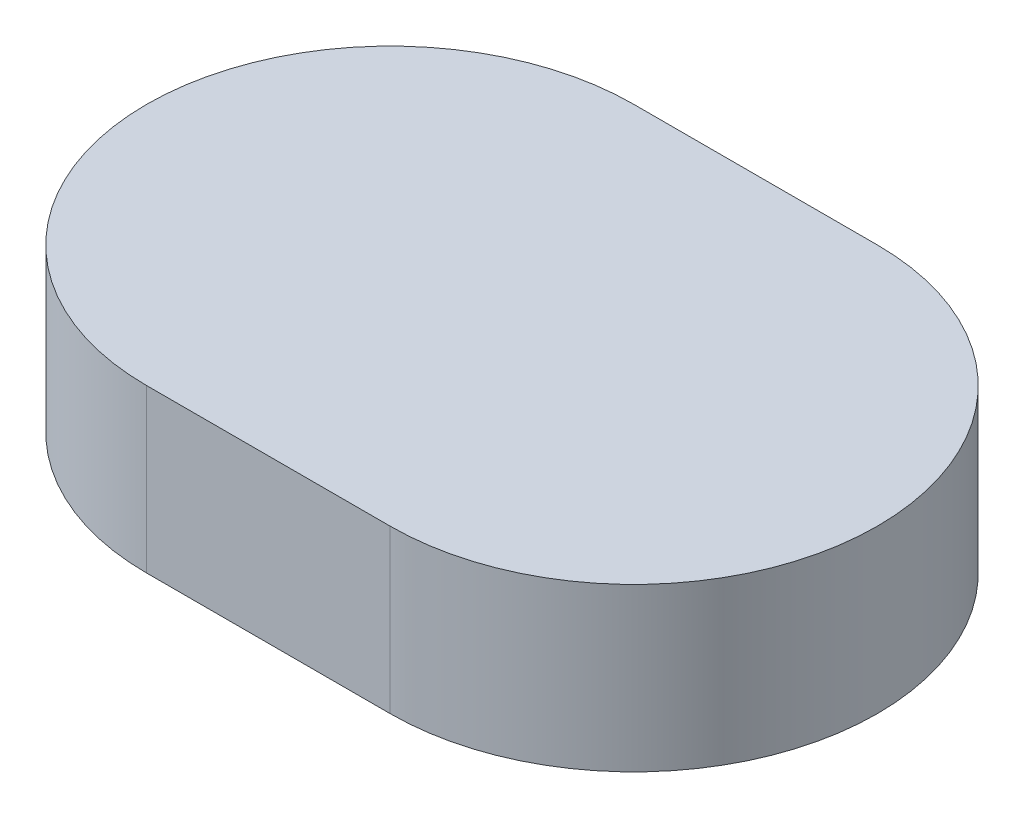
ISO-10303-21;
HEADER;
FILE_DESCRIPTION(('STEP AP214'),'2;1');
FILE_NAME('part.step','',(''),(''),'','','');
FILE_SCHEMA(('AUTOMOTIVE_DESIGN { 1 0 10303 214 1 1 1 1 }'));
ENDSEC;
DATA;
#1=APPLICATION_CONTEXT('core data for automotive mechanical design processes');
#2=APPLICATION_PROTOCOL_DEFINITION('international standard','automotive_design',2000,#1);
#3=PRODUCT_CONTEXT('',#1,'mechanical');
#4=PRODUCT('Part','Part','',(#3));
#5=PRODUCT_RELATED_PRODUCT_CATEGORY('part','',(#4));
#6=PRODUCT_DEFINITION_FORMATION('','',#4);
#7=PRODUCT_DEFINITION_CONTEXT('part definition',#1,'design');
#8=PRODUCT_DEFINITION('design','',#6,#7);
#9=PRODUCT_DEFINITION_SHAPE('','',#8);
#10=(LENGTH_UNIT() NAMED_UNIT(*) SI_UNIT(.MILLI.,.METRE.));
#11=(NAMED_UNIT(*) PLANE_ANGLE_UNIT() SI_UNIT($,.RADIAN.));
#12=(NAMED_UNIT(*) SI_UNIT($,.STERADIAN.) SOLID_ANGLE_UNIT());
#13=UNCERTAINTY_MEASURE_WITH_UNIT(LENGTH_MEASURE(1.E-05),#10,'distance_accuracy_value','');
#14=(GEOMETRIC_REPRESENTATION_CONTEXT(3) GLOBAL_UNCERTAINTY_ASSIGNED_CONTEXT((#13)) GLOBAL_UNIT_ASSIGNED_CONTEXT((#10,
#11,#12)) REPRESENTATION_CONTEXT('',''));
#15=CARTESIAN_POINT('',(0.,0.,0.));
#16=DIRECTION('',(0.,0.,1.));
#17=DIRECTION('',(1.,0.,0.));
#18=AXIS2_PLACEMENT_3D('',#15,#16,#17);
#19=CARTESIAN_POINT('',(-1.5,2.,0.));
#20=DIRECTION('',(0.,-1.,0.));
#21=DIRECTION('',(0.,0.,-1.));
#22=AXIS2_PLACEMENT_3D('',#19,#20,#21);
#23=CYLINDRICAL_SURFACE('',#22,3.);
#24=CARTESIAN_POINT('',(-1.5,0.,0.));
#25=DIRECTION('',(0.,1.,0.));
#26=DIRECTION('',(0.,0.,1.));
#27=AXIS2_PLACEMENT_3D('',#24,#25,#26);
#28=CIRCLE('',#27,3.);
#29=CARTESIAN_POINT('',(-1.5,0.,-3.));
#30=VERTEX_POINT('',#29);
#31=CARTESIAN_POINT('',(-1.5,0.,3.));
#32=VERTEX_POINT('',#31);
#33=EDGE_CURVE('E95',#30,#32,#28,.T.);
#34=ORIENTED_EDGE('',*,*,#33,.T.);
#35=DIRECTION('',(0.,-1.,0.));
#36=VECTOR('',#35,1.);
#37=CARTESIAN_POINT('',(-1.5,2.,3.));
#38=LINE('',#37,#36);
#39=CARTESIAN_POINT('',(-1.5,2.,3.));
#40=VERTEX_POINT('',#39);
#41=EDGE_CURVE('E11',#40,#32,#38,.T.);
#42=ORIENTED_EDGE('',*,*,#41,.F.);
#43=CARTESIAN_POINT('',(-1.5,2.,0.));
#44=DIRECTION('',(0.,1.,0.));
#45=DIRECTION('',(0.,0.,1.));
#46=AXIS2_PLACEMENT_3D('',#43,#44,#45);
#47=CIRCLE('',#46,3.);
#48=CARTESIAN_POINT('',(-1.5,2.,-3.));
#49=VERTEX_POINT('',#48);
#50=EDGE_CURVE('E83',#49,#40,#47,.T.);
#51=ORIENTED_EDGE('',*,*,#50,.F.);
#52=DIRECTION('',(0.,-1.,0.));
#53=VECTOR('',#52,1.);
#54=CARTESIAN_POINT('',(-1.5,2.,-3.));
#55=LINE('',#54,#53);
#56=EDGE_CURVE('E91',#49,#30,#55,.T.);
#57=ORIENTED_EDGE('',*,*,#56,.T.);
#58=EDGE_LOOP('',(#34,#42,#51,#57));
#59=FACE_BOUND('',#58,.T.);
#60=ADVANCED_FACE('F32',(#59),#23,.T.);
#61=CARTESIAN_POINT('',(-1.5,2.,3.));
#62=DIRECTION('',(0.,0.,-1.));
#63=DIRECTION('',(-1.,0.,0.));
#64=AXIS2_PLACEMENT_3D('',#61,#62,#63);
#65=PLANE('',#64);
#66=DIRECTION('',(1.,0.,0.));
#67=VECTOR('',#66,1.);
#68=CARTESIAN_POINT('',(-1.5,0.,3.));
#69=LINE('',#68,#67);
#70=CARTESIAN_POINT('',(1.5,0.,3.));
#71=VERTEX_POINT('',#70);
#72=EDGE_CURVE('E87',#32,#71,#69,.T.);
#73=ORIENTED_EDGE('',*,*,#72,.T.);
#74=DIRECTION('',(0.,-1.,0.));
#75=VECTOR('',#74,1.);
#76=CARTESIAN_POINT('',(1.5,2.,3.));
#77=LINE('',#76,#75);
#78=CARTESIAN_POINT('',(1.5,2.,3.));
#79=VERTEX_POINT('',#78);
#80=EDGE_CURVE('E40',#79,#71,#77,.T.);
#81=ORIENTED_EDGE('',*,*,#80,.F.);
#82=DIRECTION('',(1.,0.,0.));
#83=VECTOR('',#82,1.);
#84=CARTESIAN_POINT('',(-1.5,2.,3.));
#85=LINE('',#84,#83);
#86=EDGE_CURVE('E78',#40,#79,#85,.T.);
#87=ORIENTED_EDGE('',*,*,#86,.F.);
#88=ORIENTED_EDGE('',*,*,#41,.T.);
#89=EDGE_LOOP('',(#73,#81,#87,#88));
#90=FACE_BOUND('',#89,.T.);
#91=ADVANCED_FACE('F86',(#90),#65,.F.);
#92=CARTESIAN_POINT('',(1.5,2.,0.));
#93=DIRECTION('',(0.,-1.,0.));
#94=DIRECTION('',(0.,0.,-1.));
#95=AXIS2_PLACEMENT_3D('',#92,#93,#94);
#96=CYLINDRICAL_SURFACE('',#95,3.);
#97=CARTESIAN_POINT('',(1.5,0.,0.));
#98=DIRECTION('',(0.,1.,0.));
#99=DIRECTION('',(0.,0.,1.));
#100=AXIS2_PLACEMENT_3D('',#97,#98,#99);
#101=CIRCLE('',#100,3.);
#102=CARTESIAN_POINT('',(1.5,0.,-3.));
#103=VERTEX_POINT('',#102);
#104=EDGE_CURVE('E65',#71,#103,#101,.T.);
#105=ORIENTED_EDGE('',*,*,#104,.T.);
#106=DIRECTION('',(0.,-1.,0.));
#107=VECTOR('',#106,1.);
#108=CARTESIAN_POINT('',(1.5,2.,-3.));
#109=LINE('',#108,#107);
#110=CARTESIAN_POINT('',(1.5,2.,-3.));
#111=VERTEX_POINT('',#110);
#112=EDGE_CURVE('E88',#111,#103,#109,.T.);
#113=ORIENTED_EDGE('',*,*,#112,.F.);
#114=CARTESIAN_POINT('',(1.5,2.,0.));
#115=DIRECTION('',(0.,1.,0.));
#116=DIRECTION('',(0.,0.,1.));
#117=AXIS2_PLACEMENT_3D('',#114,#115,#116);
#118=CIRCLE('',#117,3.);
#119=EDGE_CURVE('E81',#79,#111,#118,.T.);
#120=ORIENTED_EDGE('',*,*,#119,.F.);
#121=ORIENTED_EDGE('',*,*,#80,.T.);
#122=EDGE_LOOP('',(#105,#113,#120,#121));
#123=FACE_BOUND('',#122,.T.);
#124=ADVANCED_FACE('F89',(#123),#96,.T.);
#125=CARTESIAN_POINT('',(-1.5,2.,-3.));
#126=DIRECTION('',(0.,0.,1.));
#127=DIRECTION('',(1.,0.,0.));
#128=AXIS2_PLACEMENT_3D('',#125,#126,#127);
#129=PLANE('',#128);
#130=DIRECTION('',(-1.,0.,0.));
#131=VECTOR('',#130,1.);
#132=CARTESIAN_POINT('',(-1.5,0.,-3.));
#133=LINE('',#132,#131);
#134=EDGE_CURVE('E71',#103,#30,#133,.T.);
#135=ORIENTED_EDGE('',*,*,#134,.T.);
#136=ORIENTED_EDGE('',*,*,#56,.F.);
#137=DIRECTION('',(-1.,0.,0.));
#138=VECTOR('',#137,1.);
#139=CARTESIAN_POINT('',(-1.5,2.,-3.));
#140=LINE('',#139,#138);
#141=EDGE_CURVE('E48',#111,#49,#140,.T.);
#142=ORIENTED_EDGE('',*,*,#141,.F.);
#143=ORIENTED_EDGE('',*,*,#112,.T.);
#144=EDGE_LOOP('',(#135,#136,#142,#143));
#145=FACE_BOUND('',#144,.T.);
#146=ADVANCED_FACE('F102',(#145),#129,.F.);
#147=CARTESIAN_POINT('',(-1.5,2.,0.));
#148=DIRECTION('',(0.,1.,0.));
#149=DIRECTION('',(0.,0.,1.));
#150=AXIS2_PLACEMENT_3D('',#147,#148,#149);
#151=PLANE('',#150);
#152=ORIENTED_EDGE('',*,*,#50,.T.);
#153=ORIENTED_EDGE('',*,*,#86,.T.);
#154=ORIENTED_EDGE('',*,*,#119,.T.);
#155=ORIENTED_EDGE('',*,*,#141,.T.);
#156=EDGE_LOOP('',(#152,#153,#154,#155));
#157=FACE_BOUND('',#156,.T.);
#158=ADVANCED_FACE('F79',(#157),#151,.T.);
#159=CARTESIAN_POINT('',(-1.5,0.,0.));
#160=DIRECTION('',(0.,1.,0.));
#161=DIRECTION('',(0.,0.,1.));
#162=AXIS2_PLACEMENT_3D('',#159,#160,#161);
#163=PLANE('',#162);
#164=ORIENTED_EDGE('',*,*,#33,.F.);
#165=ORIENTED_EDGE('',*,*,#134,.F.);
#166=ORIENTED_EDGE('',*,*,#104,.F.);
#167=ORIENTED_EDGE('',*,*,#72,.F.);
#168=EDGE_LOOP('',(#164,#165,#166,#167));
#169=FACE_BOUND('',#168,.T.);
#170=ADVANCED_FACE('F105',(#169),#163,.F.);
#171=CLOSED_SHELL('',(#60,#91,#124,#146,#158,#170));
#172=MANIFOLD_SOLID_BREP('B2',#171);
#173=ADVANCED_BREP_SHAPE_REPRESENTATION('',(#18,#172),#14);
#174=SHAPE_DEFINITION_REPRESENTATION(#9,#173);
ENDSEC;
END-ISO-10303-21;
